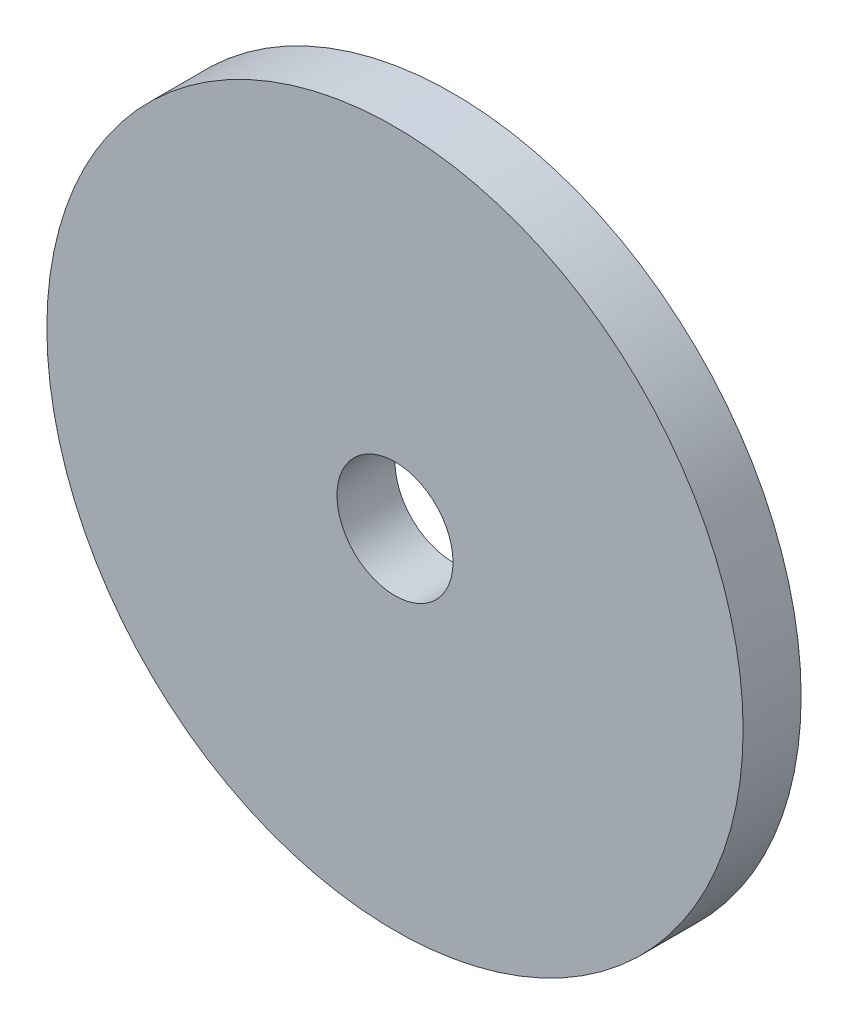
ISO-10303-21;
HEADER;
FILE_DESCRIPTION(('STEP AP214'),'2;1');
FILE_NAME('part.step','',(''),(''),'','','');
FILE_SCHEMA(('AUTOMOTIVE_DESIGN { 1 0 10303 214 1 1 1 1 }'));
ENDSEC;
DATA;
#1=APPLICATION_CONTEXT('core data for automotive mechanical design processes');
#2=APPLICATION_PROTOCOL_DEFINITION('international standard','automotive_design',2000,#1);
#3=PRODUCT_CONTEXT('',#1,'mechanical');
#4=PRODUCT('Part','Part','',(#3));
#5=PRODUCT_RELATED_PRODUCT_CATEGORY('part','',(#4));
#6=PRODUCT_DEFINITION_FORMATION('','',#4);
#7=PRODUCT_DEFINITION_CONTEXT('part definition',#1,'design');
#8=PRODUCT_DEFINITION('design','',#6,#7);
#9=PRODUCT_DEFINITION_SHAPE('','',#8);
#10=(LENGTH_UNIT() NAMED_UNIT(*) SI_UNIT(.MILLI.,.METRE.));
#11=(NAMED_UNIT(*) PLANE_ANGLE_UNIT() SI_UNIT($,.RADIAN.));
#12=(NAMED_UNIT(*) SI_UNIT($,.STERADIAN.) SOLID_ANGLE_UNIT());
#13=UNCERTAINTY_MEASURE_WITH_UNIT(LENGTH_MEASURE(1.E-05),#10,'distance_accuracy_value','');
#14=(GEOMETRIC_REPRESENTATION_CONTEXT(3) GLOBAL_UNCERTAINTY_ASSIGNED_CONTEXT((#13)) GLOBAL_UNIT_ASSIGNED_CONTEXT((#10,
#11,#12)) REPRESENTATION_CONTEXT('',''));
#15=CARTESIAN_POINT('',(0.,0.,0.));
#16=DIRECTION('',(0.,0.,1.));
#17=DIRECTION('',(1.,0.,0.));
#18=AXIS2_PLACEMENT_3D('',#15,#16,#17);
#19=CARTESIAN_POINT('',(0.,0.,3.175));
#20=DIRECTION('',(0.,0.,1.));
#21=DIRECTION('',(1.,0.,0.));
#22=AXIS2_PLACEMENT_3D('',#19,#20,#21);
#23=PLANE('',#22);
#24=CARTESIAN_POINT('',(0.,0.,3.175));
#25=DIRECTION('',(0.,0.,1.));
#26=DIRECTION('',(1.,0.,0.));
#27=AXIS2_PLACEMENT_3D('',#24,#25,#26);
#28=CIRCLE('',#27,19.05);
#29=CARTESIAN_POINT('',(19.05,0.,3.175));
#30=VERTEX_POINT('',#29);
#31=EDGE_CURVE('E10',#30,#30,#28,.T.);
#32=ORIENTED_EDGE('',*,*,#31,.T.);
#33=EDGE_LOOP('',(#32));
#34=FACE_BOUND('',#33,.T.);
#35=CARTESIAN_POINT('',(0.,0.,3.175));
#36=DIRECTION('',(0.,0.,1.));
#37=DIRECTION('',(1.,0.,0.));
#38=AXIS2_PLACEMENT_3D('',#35,#36,#37);
#39=CIRCLE('',#38,3.175);
#40=CARTESIAN_POINT('',(3.175,0.,3.175));
#41=VERTEX_POINT('',#40);
#42=EDGE_CURVE('E42',#41,#41,#39,.T.);
#43=ORIENTED_EDGE('',*,*,#42,.F.);
#44=EDGE_LOOP('',(#43));
#45=FACE_BOUND('',#44,.T.);
#46=ADVANCED_FACE('F31',(#34,#45),#23,.T.);
#47=CARTESIAN_POINT('',(0.,0.,0.));
#48=DIRECTION('',(0.,0.,1.));
#49=DIRECTION('',(1.,0.,0.));
#50=AXIS2_PLACEMENT_3D('',#47,#48,#49);
#51=PLANE('',#50);
#52=CARTESIAN_POINT('',(0.,0.,0.));
#53=DIRECTION('',(0.,0.,1.));
#54=DIRECTION('',(1.,0.,0.));
#55=AXIS2_PLACEMENT_3D('',#52,#53,#54);
#56=CIRCLE('',#55,19.05);
#57=CARTESIAN_POINT('',(19.05,0.,0.));
#58=VERTEX_POINT('',#57);
#59=EDGE_CURVE('E35',#58,#58,#56,.T.);
#60=ORIENTED_EDGE('',*,*,#59,.F.);
#61=EDGE_LOOP('',(#60));
#62=FACE_BOUND('',#61,.T.);
#63=CARTESIAN_POINT('',(0.,0.,0.));
#64=DIRECTION('',(0.,0.,1.));
#65=DIRECTION('',(1.,0.,0.));
#66=AXIS2_PLACEMENT_3D('',#63,#64,#65);
#67=CIRCLE('',#66,3.175);
#68=CARTESIAN_POINT('',(3.175,0.,0.));
#69=VERTEX_POINT('',#68);
#70=EDGE_CURVE('E44',#69,#69,#67,.T.);
#71=ORIENTED_EDGE('',*,*,#70,.T.);
#72=EDGE_LOOP('',(#71));
#73=FACE_BOUND('',#72,.T.);
#74=ADVANCED_FACE('F54',(#62,#73),#51,.F.);
#75=CARTESIAN_POINT('',(0.,0.,3.175));
#76=DIRECTION('',(0.,0.,-1.));
#77=DIRECTION('',(-1.,0.,0.));
#78=AXIS2_PLACEMENT_3D('',#75,#76,#77);
#79=CYLINDRICAL_SURFACE('',#78,19.05);
#80=ORIENTED_EDGE('',*,*,#31,.F.);
#81=EDGE_LOOP('',(#80));
#82=FACE_BOUND('',#81,.T.);
#83=ORIENTED_EDGE('',*,*,#59,.T.);
#84=EDGE_LOOP('',(#83));
#85=FACE_BOUND('',#84,.T.);
#86=ADVANCED_FACE('F33',(#82,#85),#79,.T.);
#87=CARTESIAN_POINT('',(0.,0.,3.175));
#88=DIRECTION('',(0.,0.,-1.));
#89=DIRECTION('',(-1.,0.,0.));
#90=AXIS2_PLACEMENT_3D('',#87,#88,#89);
#91=CYLINDRICAL_SURFACE('',#90,3.175);
#92=ORIENTED_EDGE('',*,*,#42,.T.);
#93=EDGE_LOOP('',(#92));
#94=FACE_BOUND('',#93,.T.);
#95=ORIENTED_EDGE('',*,*,#70,.F.);
#96=EDGE_LOOP('',(#95));
#97=FACE_BOUND('',#96,.T.);
#98=ADVANCED_FACE('F50',(#94,#97),#91,.F.);
#99=CLOSED_SHELL('',(#46,#74,#86,#98));
#100=MANIFOLD_SOLID_BREP('B2',#99);
#101=ADVANCED_BREP_SHAPE_REPRESENTATION('',(#18,#100),#14);
#102=SHAPE_DEFINITION_REPRESENTATION(#9,#101);
ENDSEC;
END-ISO-10303-21;
